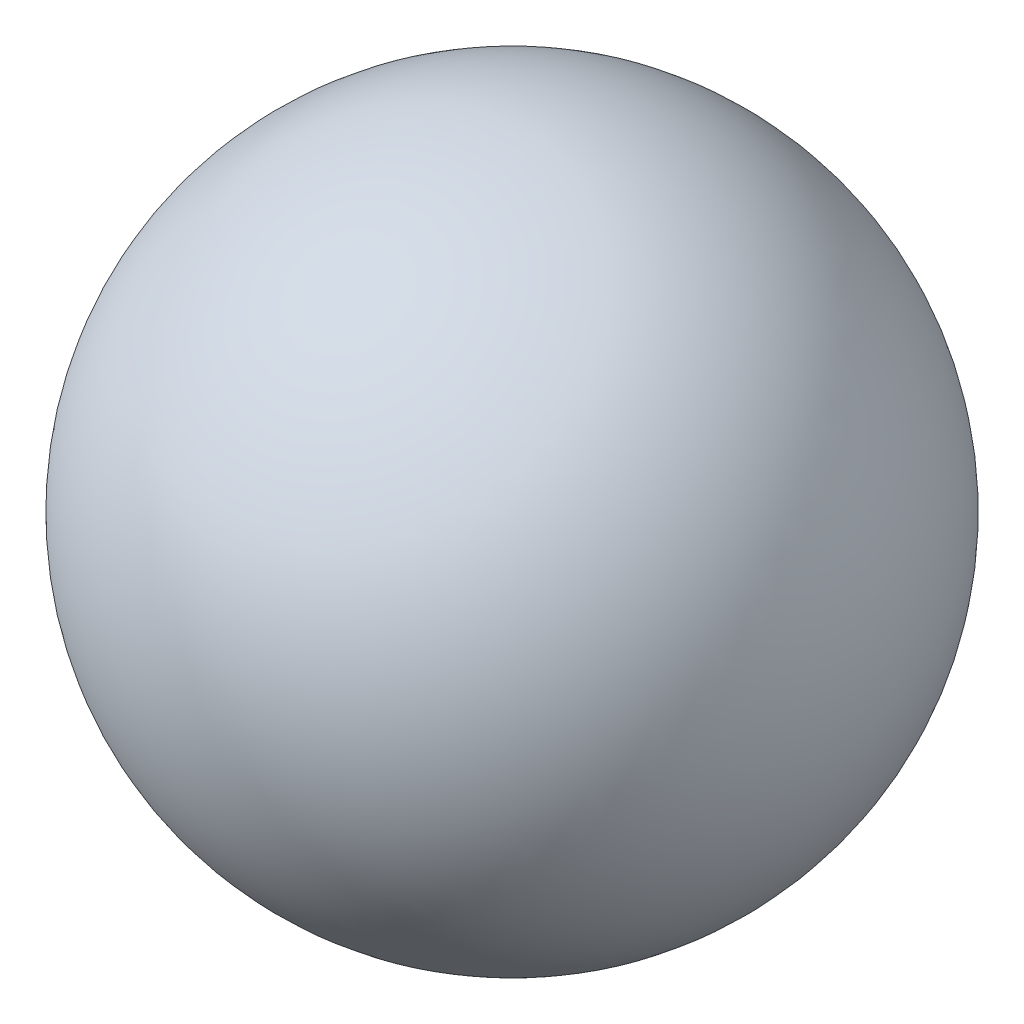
from build123d import *


with BuildPart() as part:
    # Sketch1 → Revolve1 (revolve)
    with BuildSketch(Plane.XY):
        with BuildLine():
            Line((0, 201.6252), (0, -201.6252))
            ThreePointArc((0, -201.6252), (201.6252, 0), (0, 201.6252))
        make_face()
    revolve(axis=Axis((0, 201.6252, 0), (0, -1, 0)))


solid = part.part
